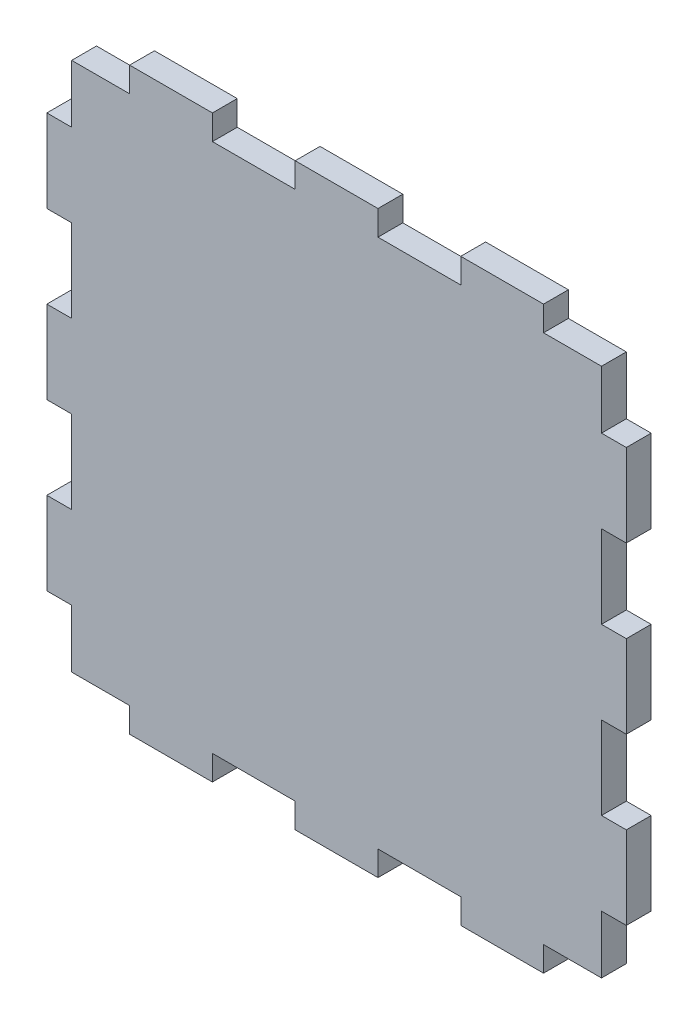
from build123d import *

# Parameters (mm, degrees)
SKETCH1_W           = 70
SKETCH1_H           = 70
BOSS_EXTRUDE2_DEPTH = 3
SKETCH3_W           = 10
SKETCH3_H           = 3
CUT_EXTRUDE3_DEPTH  = 33
SKETCH4_W           = 10
SKETCH4_H           = 3
CUT_EXTRUDE4_DEPTH  = 33
SKETCH5_W           = 3
SKETCH5_H           = 10
CUT_EXTRUDE5_DEPTH  = 33
SKETCH6_W           = 3
SKETCH6_H           = 10
CUT_EXTRUDE6_DEPTH  = 33


with BuildPart() as part:
    # Sketch1 → Boss-Extrude2 (new body)
    with BuildSketch(Plane.XY):
        with Locations((35, -35)):
            Rectangle(SKETCH1_W, SKETCH1_H)
    extrude(amount=BOSS_EXTRUDE2_DEPTH)

    # Sketch3 → Cut-Extrude3 (cut)
    with BuildSketch(Plane.XY.offset(3)):
        with Locations((25, -1.5)):
            Rectangle(SKETCH3_W, SKETCH3_H)
        with Locations((5, -1.5)):
            Rectangle(SKETCH3_W, SKETCH3_H)
        with Locations((45, -1.5)):
            Rectangle(SKETCH3_W, SKETCH3_H)
        with Locations((65, -1.5)):
            Rectangle(SKETCH3_W, SKETCH3_H)
    extrude(amount=-CUT_EXTRUDE3_DEPTH, mode=Mode.SUBTRACT)

    # Sketch4 → Cut-Extrude4 (cut)
    with BuildSketch(Plane.XY.offset(3)):
        with Locations((25, -68.5)):
            Rectangle(SKETCH4_W, SKETCH4_H)
        with Locations((5, -68.5)):
            Rectangle(SKETCH4_W, SKETCH4_H)
        with Locations((45, -68.5)):
            Rectangle(SKETCH4_W, SKETCH4_H)
        with Locations((65, -68.5)):
            Rectangle(SKETCH4_W, SKETCH4_H)
    extrude(amount=-CUT_EXTRUDE4_DEPTH, mode=Mode.SUBTRACT)

    # Sketch5 → Cut-Extrude5 (cut)
    with BuildSketch(Plane.XY.offset(3)):
        with Locations((1.5, -5)):
            Rectangle(SKETCH5_W, SKETCH5_H)
        with Locations((1.5, -25)):
            Rectangle(SKETCH5_W, SKETCH5_H)
        with Locations((1.5, -45)):
            Rectangle(SKETCH5_W, SKETCH5_H)
        with Locations((1.5, -65)):
            Rectangle(SKETCH5_W, SKETCH5_H)
    extrude(amount=-CUT_EXTRUDE5_DEPTH, mode=Mode.SUBTRACT)

    # Sketch6 → Cut-Extrude6 (cut)
    with BuildSketch(Plane.XY.offset(3)):
        with Locations((68.5, -25)):
            Rectangle(SKETCH6_W, SKETCH6_H)
        with Locations((68.5, -5)):
            Rectangle(SKETCH6_W, SKETCH6_H)
        with Locations((68.5, -45)):
            Rectangle(SKETCH6_W, SKETCH6_H)
        with Locations((68.5, -65)):
            Rectangle(SKETCH6_W, SKETCH6_H)
    extrude(amount=-CUT_EXTRUDE6_DEPTH, mode=Mode.SUBTRACT)


solid = part.part
